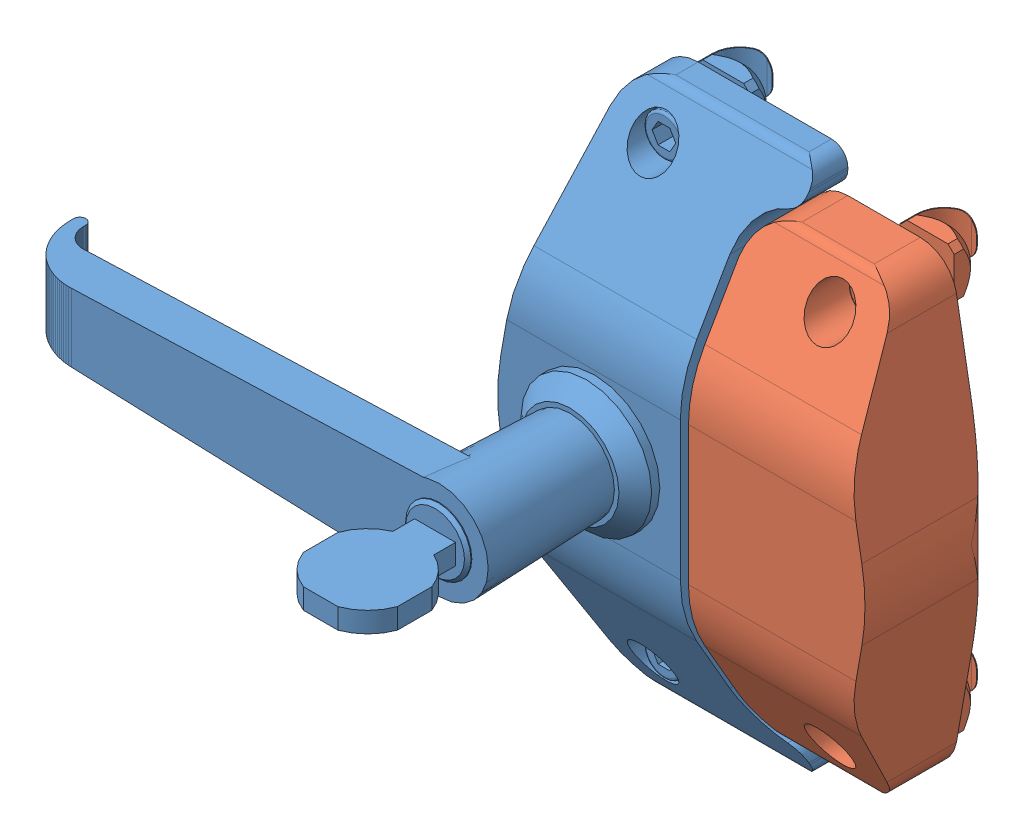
SolidWorks assembly 21.0948 ROTARY LOCK  45.sldasm, configuration Default (file format 6000). Lengths in mm.
Overall size (171.19 130 112.3).
2 component instances, 2 part files, 0 mates.
Components (placement in the parent):
- 21.0948 ROTARY LOCK 45 HANDLE-1: 21.0948 ROTARY LOCK 45 HANDLE.sldprt [Default] at origin size (150.5 130 112.3)
- 21.0948 ROTARY LOCK 45 CATCH-1: 21.0948 ROTARY LOCK 45 CATCH.sldprt [Default] at origin size (43.19 110 45.3)
